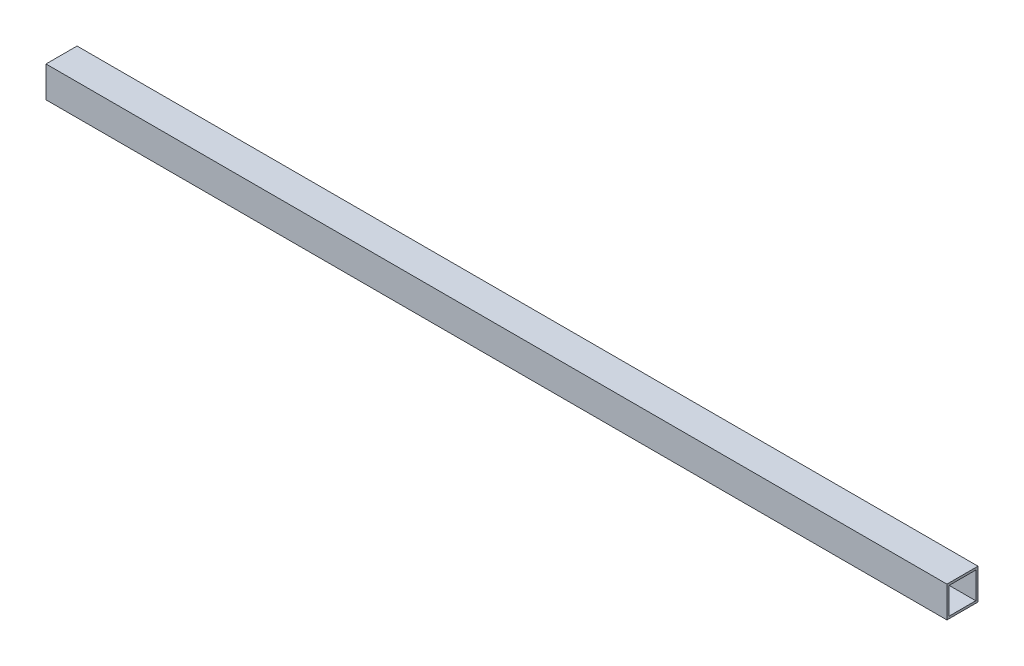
from build123d import *

# Parameters (mm, degrees)
SKETCH1_W      = 50.8
SKETCH1_H      = 50.8
SKETCH1_W_2    = 43.4848
SKETCH1_H_2    = 43.4848
EXTRUDE1_DEPTH = 1473.2


with BuildPart() as part:
    # Sketch1 → Extrude1 (new body)
    with BuildSketch(Plane(origin=(0, 0, 0), x_dir=(0, 0, -1), z_dir=(1, 0, 0))):
        with Locations((25.4, 25.4)):
            Rectangle(SKETCH1_W, SKETCH1_H)
        with Locations((25.4, 25.4)):
            Rectangle(SKETCH1_W_2, SKETCH1_H_2, mode=Mode.SUBTRACT)
    extrude(amount=EXTRUDE1_DEPTH)


solid = part.part
